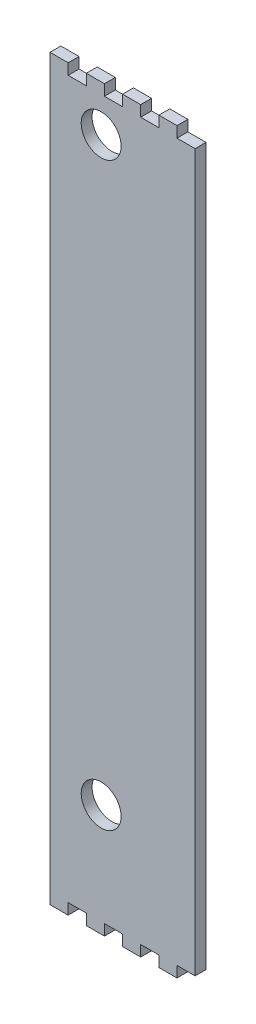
from build123d import *

# Parameters (mm, degrees)
ESTRUSIONE_ESTRUSIONE1_DEPTH = 6
SCHIZZO2_R                   = 11
TAGLIO_ESTRUSIONE1_DEPTH     = 208.480721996


with BuildPart() as part:
    # Schizzo1 → Estrusione-Estrusione1 (new body)
    with BuildSketch(Plane.XY):
        Polygon((-40, 203.5), (-30, 203.5), (-30, 197.5), (-20, 197.5), (-20, 203.5), (-10, 203.5), (-10, 197.5), (0, 197.5), (0, 203.5), (10, 203.5), (10, 197.5), (20, 197.5), (20, 203.5), (30, 203.5), (30, 197.5), (40, 197.5), (40, -197.5), (30, -197.5), (30, -203.5), (20, -203.5), (20, -197.5), (10, -197.5), (10, -203.5), (0, -203.5), (0, -197.5), (-10, -197.5), (-10, -203.5), (-20, -203.5), (-20, -197.5), (-30, -197.5), (-30, -203.5), (-40, -203.5), align=None)
    extrude(amount=ESTRUSIONE_ESTRUSIONE1_DEPTH)

    # Schizzo2 → Taglio-Estrusione1 (cut, through all)
    with BuildSketch(Plane(origin=(0, 0, 0), x_dir=(-1, 0, 0), z_dir=(0, 0, -1))):
        with Locations((11.806252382, 178.221227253)):
            Circle(SCHIZZO2_R)
        with Locations((11.806252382, -141.778772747)):
            Circle(SCHIZZO2_R)
    extrude(amount=-TAGLIO_ESTRUSIONE1_DEPTH, mode=Mode.SUBTRACT)


solid = part.part
